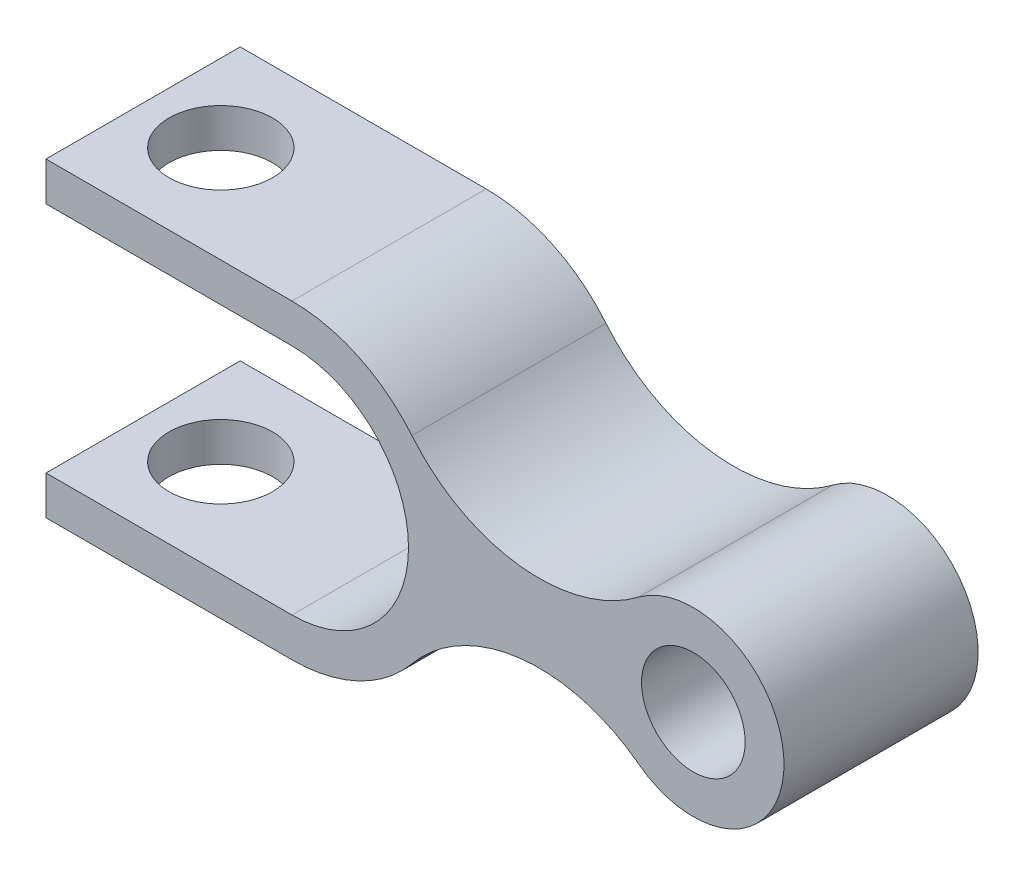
from build123d import *

# Parameters (mm, degrees)
ESQUISSE1_R             = 4
BASE_EXTRUSION_DEPTH    = 7.5
ESQUISSE2_R             = 4
ENL_V_MAT_EXTRU_1_DEPTH = 137.338732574


with BuildPart() as part:
    # Esquisse1 → Base-Extrusion (new, symmetric)
    with BuildSketch(Plane.XY):
        with BuildLine():
            Line((77, 12), (96, 12))
            ThreePointArc((96, 12), (101.117875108, 10.853909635), (105.258158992, 7.634559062))
            ThreePointArc((105.258158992, 7.634559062), (113.604121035, 3.086603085), (122.775503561, 5.581543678))
            ThreePointArc((122.775503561, 5.581543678), (134, 0), (122.775503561, -5.581543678))
            ThreePointArc((122.775503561, -5.581543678), (113.604121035, -3.086603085), (105.258158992, -7.634559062))
            ThreePointArc((105.258158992, -7.634559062), (101.117875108, -10.853909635), (96, -12))
            Line((96, -12), (77, -12))
            Line((77, -12), (77, -9))
            Line((77, -9), (96, -9))
            ThreePointArc((96, -9), (105, 0), (96, 9))
            Line((96, 9), (77, 9))
            Line((77, 9), (77, 12))
        make_face()
        with Locations((127, 0)):
            Circle(ESQUISSE1_R, mode=Mode.SUBTRACT)
    extrude(amount=BASE_EXTRUSION_DEPTH, both=True)

    # Esquisse2 → Enl_v. mat.-Extru.1 (cut, through all)
    with BuildSketch(Plane.XZ.offset(12)):
        with Locations((83, 0)):
            Circle(ESQUISSE2_R)
    extrude(amount=-ENL_V_MAT_EXTRU_1_DEPTH, mode=Mode.SUBTRACT)


solid = part.part
